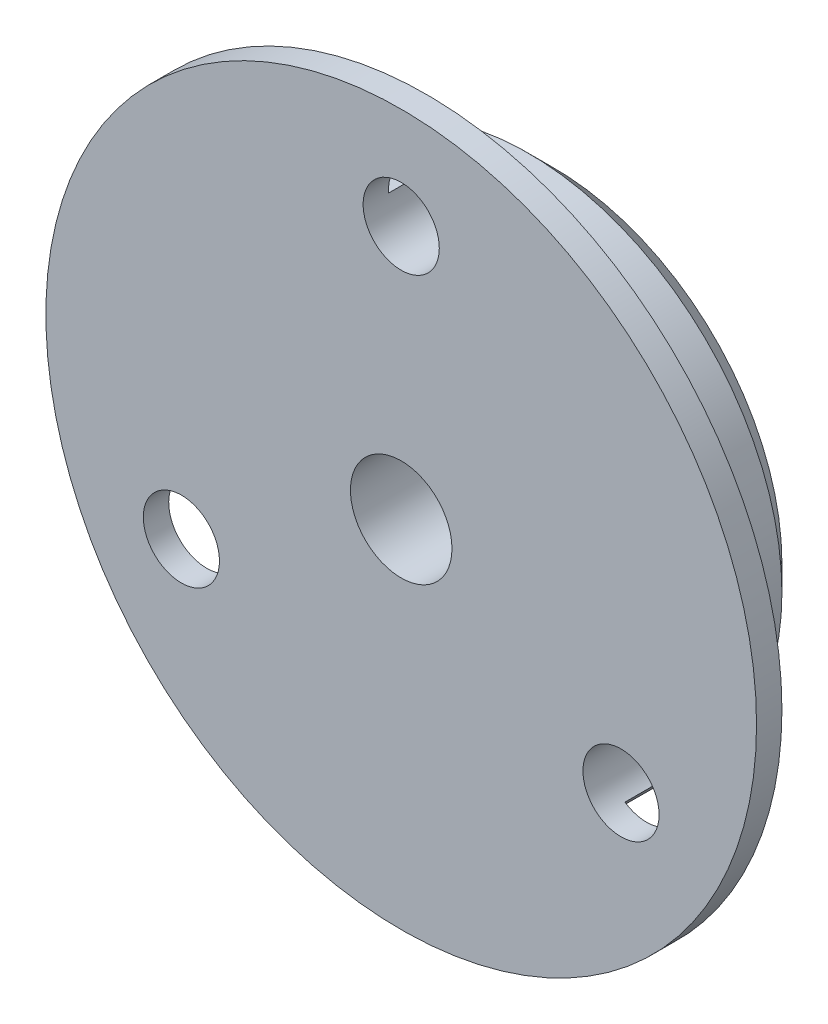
from build123d import *

# Parameters (mm, degrees)
ESQUISSE1_R             = 10
EXTRUSION1_DEPTH        = 5
CHANFREIN1_SIZE         = 1
ESQUISSE2_R             = 14
EXTRUSION2_DEPTH        = 1
ESQUISSE3_R             = 2
ENL_V_MAT_EXTRU_1_DEPTH = 21.688160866
ESQUISSE4_R             = 1.5
ENL_V_MAT_EXTRU_2_DEPTH = 3


with BuildPart() as part:
    # Esquisse1 → Extrusion1 (new body)
    with BuildSketch(Plane.XY):
        Circle(ESQUISSE1_R)
    extrude(amount=EXTRUSION1_DEPTH)

    # Chanfrein1
    chanfrein1_edges = [part.edges().sort_by_distance(p)[0] for p in [
        (-10, 0, 0),
    ]]
    chamfer(chanfrein1_edges, length=CHANFREIN1_SIZE)

    # Esquisse2 → Extrusion2 (add)
    with BuildSketch(Plane.XY.offset(5)):
        Circle(ESQUISSE2_R)
    extrude(amount=EXTRUSION2_DEPTH)

    # Esquisse3 → Enl_v. mat.-Extru.1 (cut, through all)
    with BuildSketch(Plane.XY.offset(6)):
        Circle(ESQUISSE3_R)
    extrude(amount=-ENL_V_MAT_EXTRU_1_DEPTH, mode=Mode.SUBTRACT)

    # Esquisse4 → Enl_v. mat.-Extru.2 (cut)
    with BuildSketch(Plane.XY.offset(6)):
        with Locations((0, 10)):
            Circle(ESQUISSE4_R)
        with Locations((8.660254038, -5)):
            Circle(ESQUISSE4_R)
        with Locations((-8.660254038, -5)):
            Circle(ESQUISSE4_R)
    extrude(amount=-ENL_V_MAT_EXTRU_2_DEPTH, mode=Mode.SUBTRACT)


solid = part.part
